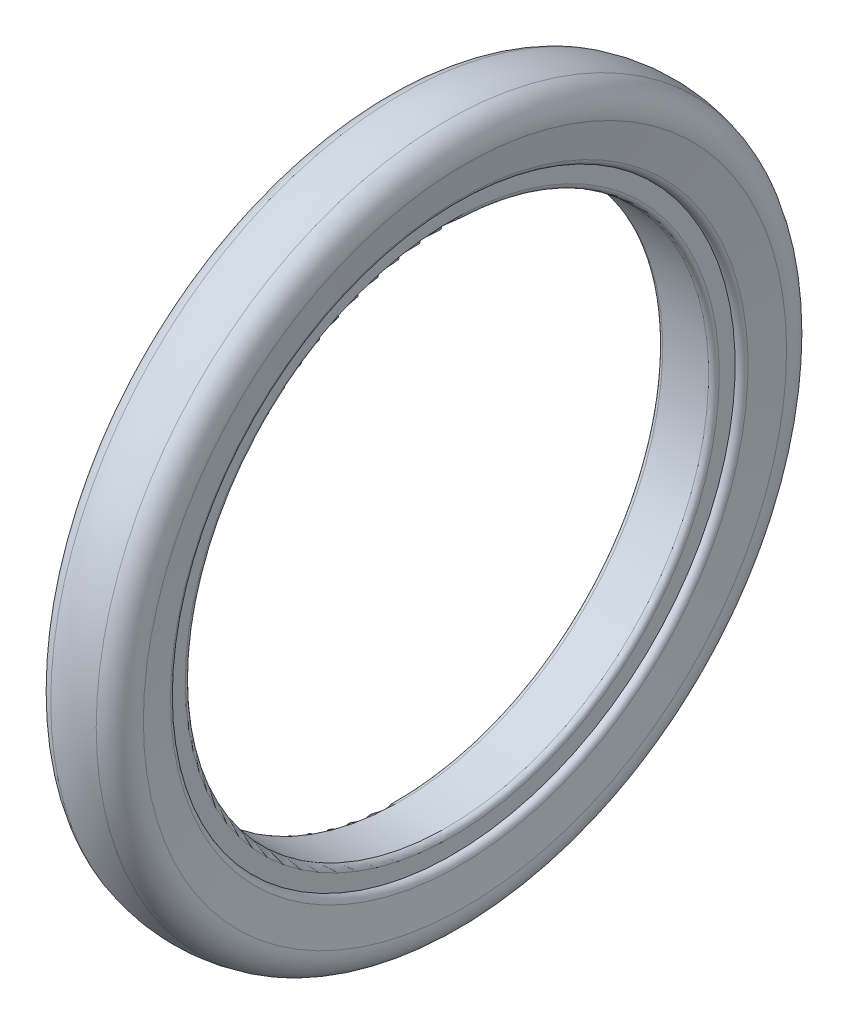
ISO-10303-21;
HEADER;
FILE_DESCRIPTION(('STEP AP214'),'2;1');
FILE_NAME('part.step','',(''),(''),'','','');
FILE_SCHEMA(('AUTOMOTIVE_DESIGN { 1 0 10303 214 1 1 1 1 }'));
ENDSEC;
DATA;
#1=APPLICATION_CONTEXT('core data for automotive mechanical design processes');
#2=APPLICATION_PROTOCOL_DEFINITION('international standard','automotive_design',2000,#1);
#3=PRODUCT_CONTEXT('',#1,'mechanical');
#4=PRODUCT('Part','Part','',(#3));
#5=PRODUCT_RELATED_PRODUCT_CATEGORY('part','',(#4));
#6=PRODUCT_DEFINITION_FORMATION('','',#4);
#7=PRODUCT_DEFINITION_CONTEXT('part definition',#1,'design');
#8=PRODUCT_DEFINITION('design','',#6,#7);
#9=PRODUCT_DEFINITION_SHAPE('','',#8);
#10=(LENGTH_UNIT() NAMED_UNIT(*) SI_UNIT(.MILLI.,.METRE.));
#11=(NAMED_UNIT(*) PLANE_ANGLE_UNIT() SI_UNIT($,.RADIAN.));
#12=(NAMED_UNIT(*) SI_UNIT($,.STERADIAN.) SOLID_ANGLE_UNIT());
#13=UNCERTAINTY_MEASURE_WITH_UNIT(LENGTH_MEASURE(1.E-05),#10,'distance_accuracy_value','');
#14=(GEOMETRIC_REPRESENTATION_CONTEXT(3) GLOBAL_UNCERTAINTY_ASSIGNED_CONTEXT((#13)) GLOBAL_UNIT_ASSIGNED_CONTEXT((#10,
#11,#12)) REPRESENTATION_CONTEXT('',''));
#15=CARTESIAN_POINT('',(0.,0.,0.));
#16=DIRECTION('',(0.,0.,1.));
#17=DIRECTION('',(1.,0.,0.));
#18=AXIS2_PLACEMENT_3D('',#15,#16,#17);
#19=CARTESIAN_POINT('',(-25.4,0.,0.));
#20=DIRECTION('',(-1.,0.,0.));
#21=DIRECTION('',(0.,0.,1.));
#22=AXIS2_PLACEMENT_3D('',#19,#20,#21);
#23=TOROIDAL_SURFACE('',#22,260.35,6.35000000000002);
#24=CARTESIAN_POINT('',(-25.4,0.,0.));
#25=DIRECTION('',(-1.,0.,0.));
#26=DIRECTION('',(0.,0.,1.));
#27=AXIS2_PLACEMENT_3D('',#24,#25,#26);
#28=CIRCLE('',#27,254.);
#29=CARTESIAN_POINT('',(-25.4,0.,254.));
#30=VERTEX_POINT('',#29);
#31=EDGE_CURVE('E11',#30,#30,#28,.T.);
#32=ORIENTED_EDGE('',*,*,#31,.F.);
#33=EDGE_LOOP('',(#32));
#34=FACE_BOUND('',#33,.T.);
#35=CARTESIAN_POINT('',(-31.6553481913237,0.,0.));
#36=DIRECTION('',(-1.,0.,0.));
#37=DIRECTION('',(0.,0.,1.));
#38=AXIS2_PLACEMENT_3D('',#35,#36,#37);
#39=CIRCLE('',#38,259.257700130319);
#40=CARTESIAN_POINT('',(-31.6553481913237,0.,259.257700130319));
#41=VERTEX_POINT('',#40);
#42=EDGE_CURVE('E69',#41,#41,#39,.T.);
#43=ORIENTED_EDGE('',*,*,#42,.T.);
#44=EDGE_LOOP('',(#43));
#45=FACE_BOUND('',#44,.T.);
#46=ADVANCED_FACE('F41',(#34,#45),#23,.T.);
#47=CARTESIAN_POINT('',(0.,0.,0.));
#48=DIRECTION('',(-1.,0.,0.));
#49=DIRECTION('',(0.,0.,1.));
#50=AXIS2_PLACEMENT_3D('',#47,#48,#49);
#51=CYLINDRICAL_SURFACE('',#50,254.);
#52=CARTESIAN_POINT('',(25.4,0.,0.));
#53=DIRECTION('',(-1.,0.,0.));
#54=DIRECTION('',(0.,0.,1.));
#55=AXIS2_PLACEMENT_3D('',#52,#53,#54);
#56=CIRCLE('',#55,254.);
#57=CARTESIAN_POINT('',(25.4,0.,254.));
#58=VERTEX_POINT('',#57);
#59=EDGE_CURVE('E47',#58,#58,#56,.T.);
#60=ORIENTED_EDGE('',*,*,#59,.F.);
#61=EDGE_LOOP('',(#60));
#62=FACE_BOUND('',#61,.T.);
#63=ORIENTED_EDGE('',*,*,#31,.T.);
#64=EDGE_LOOP('',(#63));
#65=FACE_BOUND('',#64,.T.);
#66=ADVANCED_FACE('F106',(#62,#65),#51,.F.);
#67=CARTESIAN_POINT('',(25.4,0.,0.));
#68=DIRECTION('',(-1.,0.,0.));
#69=DIRECTION('',(0.,0.,1.));
#70=AXIS2_PLACEMENT_3D('',#67,#68,#69);
#71=TOROIDAL_SURFACE('',#70,260.35,6.35000000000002);
#72=CARTESIAN_POINT('',(31.6553481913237,0.,0.));
#73=DIRECTION('',(-1.,0.,0.));
#74=DIRECTION('',(0.,0.,1.));
#75=AXIS2_PLACEMENT_3D('',#72,#73,#74);
#76=CIRCLE('',#75,259.257700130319);
#77=CARTESIAN_POINT('',(31.6553481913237,0.,259.257700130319));
#78=VERTEX_POINT('',#77);
#79=EDGE_CURVE('E51',#78,#78,#76,.T.);
#80=ORIENTED_EDGE('',*,*,#79,.F.);
#81=EDGE_LOOP('',(#80));
#82=FACE_BOUND('',#81,.T.);
#83=ORIENTED_EDGE('',*,*,#59,.T.);
#84=EDGE_LOOP('',(#83));
#85=FACE_BOUND('',#84,.T.);
#86=ADVANCED_FACE('F101',(#82,#85),#71,.T.);
#87=CARTESIAN_POINT('',(31.6553481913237,0.,0.));
#88=DIRECTION('',(1.,0.,0.));
#89=DIRECTION('',(0.,0.,-1.));
#90=AXIS2_PLACEMENT_3D('',#87,#88,#89);
#91=CONICAL_SURFACE('',#90,259.257700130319,1.39792079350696);
#92=CARTESIAN_POINT('',(36.8067534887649,0.,0.));
#93=DIRECTION('',(-1.,0.,0.));
#94=DIRECTION('',(0.,0.,1.));
#95=AXIS2_PLACEMENT_3D('',#92,#93,#94);
#96=CIRCLE('',#95,288.758604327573);
#97=CARTESIAN_POINT('',(36.8067534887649,0.,288.758604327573));
#98=VERTEX_POINT('',#97);
#99=EDGE_CURVE('E55',#98,#98,#96,.T.);
#100=ORIENTED_EDGE('',*,*,#99,.F.);
#101=EDGE_LOOP('',(#100));
#102=FACE_BOUND('',#101,.T.);
#103=ORIENTED_EDGE('',*,*,#79,.T.);
#104=EDGE_LOOP('',(#103));
#105=FACE_BOUND('',#104,.T.);
#106=ADVANCED_FACE('F95',(#102,#105),#91,.F.);
#107=CARTESIAN_POINT('',(14.2875,0.,0.));
#108=DIRECTION('',(-1.,0.,0.));
#109=DIRECTION('',(0.,0.,1.));
#110=AXIS2_PLACEMENT_3D('',#107,#108,#109);
#111=TOROIDAL_SURFACE('',#110,292.690883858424,22.86);
#112=CARTESIAN_POINT('',(20.4107142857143,0.,0.));
#113=DIRECTION('',(-1.,0.,0.));
#114=DIRECTION('',(0.,0.,1.));
#115=AXIS2_PLACEMENT_3D('',#112,#113,#114);
#116=CIRCLE('',#115,314.715548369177);
#117=CARTESIAN_POINT('',(20.4107142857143,0.,314.715548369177));
#118=VERTEX_POINT('',#117);
#119=EDGE_CURVE('E60',#118,#118,#116,.T.);
#120=ORIENTED_EDGE('',*,*,#119,.F.);
#121=EDGE_LOOP('',(#120));
#122=FACE_BOUND('',#121,.T.);
#123=ORIENTED_EDGE('',*,*,#99,.T.);
#124=EDGE_LOOP('',(#123));
#125=FACE_BOUND('',#124,.T.);
#126=ADVANCED_FACE('F89',(#122,#125),#111,.T.);
#127=CARTESIAN_POINT('',(0.,0.,0.));
#128=DIRECTION('',(-1.,0.,0.));
#129=DIRECTION('',(0.,0.,1.));
#130=AXIS2_PLACEMENT_3D('',#127,#128,#129);
#131=TOROIDAL_SURFACE('',#130,241.3,76.2);
#132=CARTESIAN_POINT('',(-20.4107142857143,0.,0.));
#133=DIRECTION('',(-1.,0.,0.));
#134=DIRECTION('',(0.,0.,1.));
#135=AXIS2_PLACEMENT_3D('',#132,#133,#134);
#136=CIRCLE('',#135,314.715548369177);
#137=CARTESIAN_POINT('',(-20.4107142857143,0.,314.715548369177));
#138=VERTEX_POINT('',#137);
#139=EDGE_CURVE('E63',#138,#138,#136,.T.);
#140=ORIENTED_EDGE('',*,*,#139,.F.);
#141=EDGE_LOOP('',(#140));
#142=FACE_BOUND('',#141,.T.);
#143=ORIENTED_EDGE('',*,*,#119,.T.);
#144=EDGE_LOOP('',(#143));
#145=FACE_BOUND('',#144,.T.);
#146=ADVANCED_FACE('F83',(#142,#145),#131,.T.);
#147=CARTESIAN_POINT('',(-14.2875,0.,0.));
#148=DIRECTION('',(-1.,0.,0.));
#149=DIRECTION('',(0.,0.,1.));
#150=AXIS2_PLACEMENT_3D('',#147,#148,#149);
#151=TOROIDAL_SURFACE('',#150,292.690883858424,22.86);
#152=CARTESIAN_POINT('',(-36.8067534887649,0.,0.));
#153=DIRECTION('',(-1.,0.,0.));
#154=DIRECTION('',(0.,0.,1.));
#155=AXIS2_PLACEMENT_3D('',#152,#153,#154);
#156=CIRCLE('',#155,288.758604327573);
#157=CARTESIAN_POINT('',(-36.8067534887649,0.,288.758604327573));
#158=VERTEX_POINT('',#157);
#159=EDGE_CURVE('E66',#158,#158,#156,.T.);
#160=ORIENTED_EDGE('',*,*,#159,.F.);
#161=EDGE_LOOP('',(#160));
#162=FACE_BOUND('',#161,.T.);
#163=ORIENTED_EDGE('',*,*,#139,.T.);
#164=EDGE_LOOP('',(#163));
#165=FACE_BOUND('',#164,.T.);
#166=ADVANCED_FACE('F77',(#162,#165),#151,.T.);
#167=CARTESIAN_POINT('',(-36.8067534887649,0.,0.));
#168=DIRECTION('',(-1.,0.,0.));
#169=DIRECTION('',(0.,0.,1.));
#170=AXIS2_PLACEMENT_3D('',#167,#168,#169);
#171=CONICAL_SURFACE('',#170,288.758604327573,1.39792079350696);
#172=ORIENTED_EDGE('',*,*,#42,.F.);
#173=EDGE_LOOP('',(#172));
#174=FACE_BOUND('',#173,.T.);
#175=ORIENTED_EDGE('',*,*,#159,.T.);
#176=EDGE_LOOP('',(#175));
#177=FACE_BOUND('',#176,.T.);
#178=ADVANCED_FACE('F74',(#174,#177),#171,.F.);
#179=CLOSED_SHELL('',(#46,#66,#86,#106,#126,#146,#166,#178));
#180=MANIFOLD_SOLID_BREP('B2',#179);
#181=CARTESIAN_POINT('',(-20.6248,0.,0.));
#182=DIRECTION('',(-1.,0.,0.));
#183=DIRECTION('',(0.,0.,1.));
#184=AXIS2_PLACEMENT_3D('',#181,#182,#183);
#185=TOROIDAL_SURFACE('',#184,239.7252,4.77520000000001);
#186=CARTESIAN_POINT('',(-20.6248000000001,0.,0.));
#187=DIRECTION('',(-1.,0.,0.));
#188=DIRECTION('',(0.,0.,1.));
#189=AXIS2_PLACEMENT_3D('',#186,#187,#188);
#190=CIRCLE('',#189,234.95);
#191=CARTESIAN_POINT('',(-20.6248000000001,0.,234.95));
#192=VERTEX_POINT('',#191);
#193=EDGE_CURVE('E40',#192,#192,#190,.T.);
#194=ORIENTED_EDGE('',*,*,#193,.F.);
#195=EDGE_LOOP('',(#194));
#196=FACE_BOUND('',#195,.T.);
#197=CARTESIAN_POINT('',(-25.4000000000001,0.,0.));
#198=DIRECTION('',(-1.,0.,0.));
#199=DIRECTION('',(0.,0.,1.));
#200=AXIS2_PLACEMENT_3D('',#197,#198,#199);
#201=CIRCLE('',#200,239.7252);
#202=CARTESIAN_POINT('',(-25.4000000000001,0.,239.7252));
#203=VERTEX_POINT('',#202);
#204=EDGE_CURVE('E185',#203,#203,#201,.T.);
#205=ORIENTED_EDGE('',*,*,#204,.T.);
#206=EDGE_LOOP('',(#205));
#207=FACE_BOUND('',#206,.T.);
#208=ADVANCED_FACE('F163',(#196,#207),#185,.T.);
#209=CARTESIAN_POINT('',(0.,0.,0.));
#210=DIRECTION('',(-1.,0.,0.));
#211=DIRECTION('',(0.,0.,1.));
#212=AXIS2_PLACEMENT_3D('',#209,#210,#211);
#213=CYLINDRICAL_SURFACE('',#212,234.95);
#214=CARTESIAN_POINT('',(20.6248000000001,0.,0.));
#215=DIRECTION('',(-1.,0.,0.));
#216=DIRECTION('',(0.,0.,1.));
#217=AXIS2_PLACEMENT_3D('',#214,#215,#216);
#218=CIRCLE('',#217,234.95);
#219=CARTESIAN_POINT('',(20.6248000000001,0.,234.95));
#220=VERTEX_POINT('',#219);
#221=EDGE_CURVE('E169',#220,#220,#218,.T.);
#222=ORIENTED_EDGE('',*,*,#221,.F.);
#223=EDGE_LOOP('',(#222));
#224=FACE_BOUND('',#223,.T.);
#225=ORIENTED_EDGE('',*,*,#193,.T.);
#226=EDGE_LOOP('',(#225));
#227=FACE_BOUND('',#226,.T.);
#228=ADVANCED_FACE('F210',(#224,#227),#213,.F.);
#229=CARTESIAN_POINT('',(20.6248,0.,0.));
#230=DIRECTION('',(-1.,0.,0.));
#231=DIRECTION('',(0.,0.,1.));
#232=AXIS2_PLACEMENT_3D('',#229,#230,#231);
#233=TOROIDAL_SURFACE('',#232,239.7252,4.77520000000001);
#234=CARTESIAN_POINT('',(25.4000000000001,0.,0.));
#235=DIRECTION('',(-1.,0.,0.));
#236=DIRECTION('',(0.,0.,1.));
#237=AXIS2_PLACEMENT_3D('',#234,#235,#236);
#238=CIRCLE('',#237,239.7252);
#239=CARTESIAN_POINT('',(25.4000000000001,0.,239.7252));
#240=VERTEX_POINT('',#239);
#241=EDGE_CURVE('E173',#240,#240,#238,.T.);
#242=ORIENTED_EDGE('',*,*,#241,.F.);
#243=EDGE_LOOP('',(#242));
#244=FACE_BOUND('',#243,.T.);
#245=ORIENTED_EDGE('',*,*,#221,.T.);
#246=EDGE_LOOP('',(#245));
#247=FACE_BOUND('',#246,.T.);
#248=ADVANCED_FACE('F205',(#244,#247),#233,.T.);
#249=CARTESIAN_POINT('',(25.4,239.7252,0.));
#250=DIRECTION('',(-1.,0.,0.));
#251=DIRECTION('',(0.,0.,1.));
#252=AXIS2_PLACEMENT_3D('',#249,#250,#251);
#253=PLANE('',#252);
#254=CARTESIAN_POINT('',(25.4,0.,0.));
#255=DIRECTION('',(-1.,0.,0.));
#256=DIRECTION('',(0.,0.,1.));
#257=AXIS2_PLACEMENT_3D('',#254,#255,#256);
#258=CIRCLE('',#257,254.);
#259=CARTESIAN_POINT('',(25.4,0.,254.));
#260=VERTEX_POINT('',#259);
#261=EDGE_CURVE('E177',#260,#260,#258,.T.);
#262=ORIENTED_EDGE('',*,*,#261,.F.);
#263=EDGE_LOOP('',(#262));
#264=FACE_BOUND('',#263,.T.);
#265=ORIENTED_EDGE('',*,*,#241,.T.);
#266=EDGE_LOOP('',(#265));
#267=FACE_BOUND('',#266,.T.);
#268=ADVANCED_FACE('F199',(#264,#267),#253,.F.);
#269=CARTESIAN_POINT('',(0.,0.,0.));
#270=DIRECTION('',(-1.,0.,0.));
#271=DIRECTION('',(0.,0.,1.));
#272=AXIS2_PLACEMENT_3D('',#269,#270,#271);
#273=CYLINDRICAL_SURFACE('',#272,254.);
#274=CARTESIAN_POINT('',(-25.4,0.,0.));
#275=DIRECTION('',(-1.,0.,0.));
#276=DIRECTION('',(0.,0.,1.));
#277=AXIS2_PLACEMENT_3D('',#274,#275,#276);
#278=CIRCLE('',#277,254.);
#279=CARTESIAN_POINT('',(-25.4,0.,254.));
#280=VERTEX_POINT('',#279);
#281=EDGE_CURVE('E182',#280,#280,#278,.T.);
#282=ORIENTED_EDGE('',*,*,#281,.F.);
#283=EDGE_LOOP('',(#282));
#284=FACE_BOUND('',#283,.T.);
#285=ORIENTED_EDGE('',*,*,#261,.T.);
#286=EDGE_LOOP('',(#285));
#287=FACE_BOUND('',#286,.T.);
#288=ADVANCED_FACE('F193',(#284,#287),#273,.T.);
#289=CARTESIAN_POINT('',(-25.4,254.,0.));
#290=DIRECTION('',(1.,0.,0.));
#291=DIRECTION('',(0.,0.,-1.));
#292=AXIS2_PLACEMENT_3D('',#289,#290,#291);
#293=PLANE('',#292);
#294=ORIENTED_EDGE('',*,*,#204,.F.);
#295=EDGE_LOOP('',(#294));
#296=FACE_BOUND('',#295,.T.);
#297=ORIENTED_EDGE('',*,*,#281,.T.);
#298=EDGE_LOOP('',(#297));
#299=FACE_BOUND('',#298,.T.);
#300=ADVANCED_FACE('F190',(#296,#299),#293,.F.);
#301=CLOSED_SHELL('',(#208,#228,#248,#268,#288,#300));
#302=MANIFOLD_SOLID_BREP('B6',#301);
#303=ADVANCED_BREP_SHAPE_REPRESENTATION('',(#18,#180,#302),#14);
#304=SHAPE_DEFINITION_REPRESENTATION(#9,#303);
ENDSEC;
END-ISO-10303-21;
